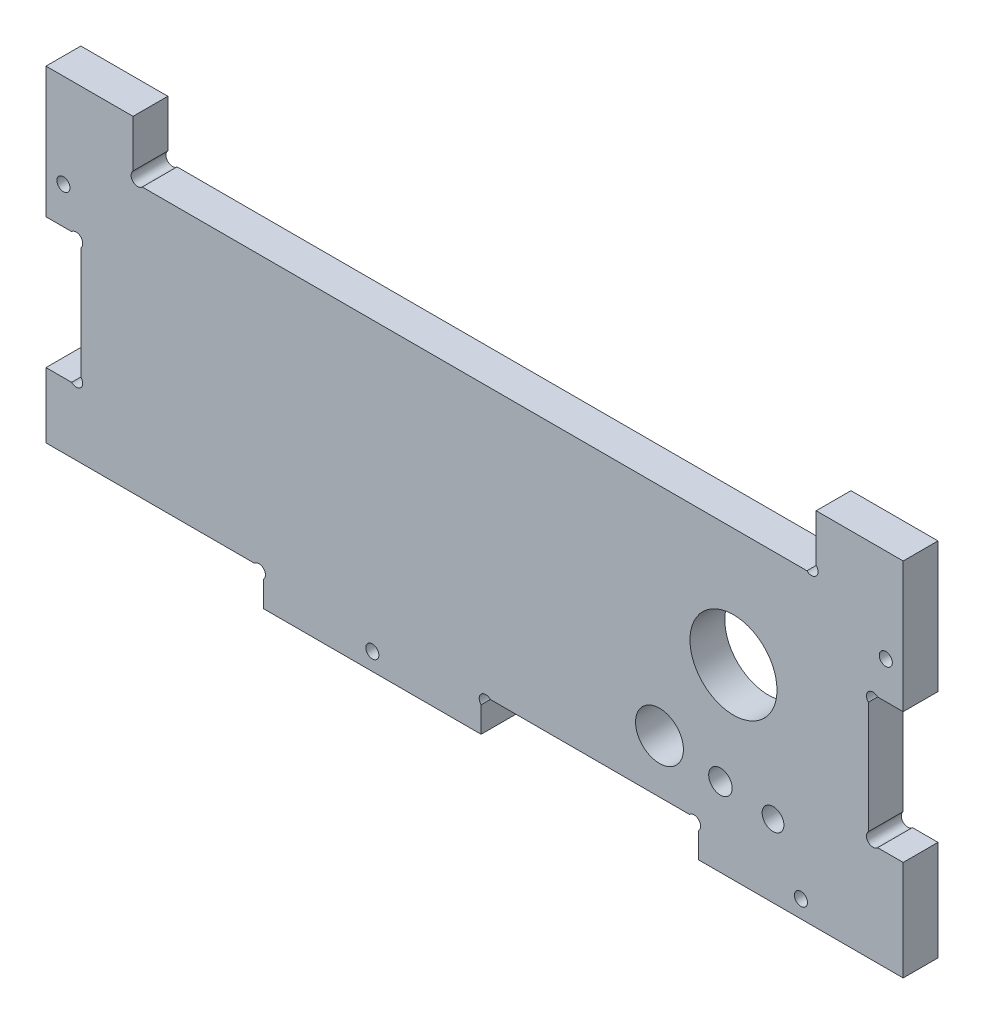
ISO-10303-21;
HEADER;
FILE_DESCRIPTION(('STEP AP214'),'2;1');
FILE_NAME('part.step','',(''),(''),'','','');
FILE_SCHEMA(('AUTOMOTIVE_DESIGN { 1 0 10303 214 1 1 1 1 }'));
ENDSEC;
DATA;
#1=APPLICATION_CONTEXT('core data for automotive mechanical design processes');
#2=APPLICATION_PROTOCOL_DEFINITION('international standard','automotive_design',2000,#1);
#3=PRODUCT_CONTEXT('',#1,'mechanical');
#4=PRODUCT('Part','Part','',(#3));
#5=PRODUCT_RELATED_PRODUCT_CATEGORY('part','',(#4));
#6=PRODUCT_DEFINITION_FORMATION('','',#4);
#7=PRODUCT_DEFINITION_CONTEXT('part definition',#1,'design');
#8=PRODUCT_DEFINITION('design','',#6,#7);
#9=PRODUCT_DEFINITION_SHAPE('','',#8);
#10=(LENGTH_UNIT() NAMED_UNIT(*) SI_UNIT(.MILLI.,.METRE.));
#11=(NAMED_UNIT(*) PLANE_ANGLE_UNIT() SI_UNIT($,.RADIAN.));
#12=(NAMED_UNIT(*) SI_UNIT($,.STERADIAN.) SOLID_ANGLE_UNIT());
#13=UNCERTAINTY_MEASURE_WITH_UNIT(LENGTH_MEASURE(1.E-05),#10,'distance_accuracy_value','');
#14=(GEOMETRIC_REPRESENTATION_CONTEXT(3) GLOBAL_UNCERTAINTY_ASSIGNED_CONTEXT((#13)) GLOBAL_UNIT_ASSIGNED_CONTEXT((#10,
#11,#12)) REPRESENTATION_CONTEXT('',''));
#15=CARTESIAN_POINT('',(0.,0.,0.));
#16=DIRECTION('',(0.,0.,1.));
#17=DIRECTION('',(1.,0.,0.));
#18=AXIS2_PLACEMENT_3D('',#15,#16,#17);
#19=CARTESIAN_POINT('',(-169.876335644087,-0.556228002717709,8.));
#20=DIRECTION('',(0.,0.,1.));
#21=DIRECTION('',(1.,0.,0.));
#22=AXIS2_PLACEMENT_3D('',#19,#20,#21);
#23=PLANE('',#22);
#24=CARTESIAN_POINT('',(16.1843245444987,36.8831118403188,8.));
#25=DIRECTION('',(0.,0.,1.));
#26=DIRECTION('',(1.,0.,0.));
#27=AXIS2_PLACEMENT_3D('',#24,#25,#26);
#28=CIRCLE('',#27,1.5);
#29=CARTESIAN_POINT('',(17.6843245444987,36.8831118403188,8.));
#30=VERTEX_POINT('',#29);
#31=EDGE_CURVE('E559',#30,#30,#28,.T.);
#32=ORIENTED_EDGE('',*,*,#31,.F.);
#33=EDGE_LOOP('',(#32));
#34=FACE_BOUND('',#33,.T.);
#35=CARTESIAN_POINT('',(-101.815675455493,-20.616888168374,8.));
#36=DIRECTION('',(0.,0.,1.));
#37=DIRECTION('',(1.,0.,0.));
#38=AXIS2_PLACEMENT_3D('',#35,#36,#37);
#39=CIRCLE('',#38,1.50000000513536);
#40=CARTESIAN_POINT('',(-100.315675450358,-20.616888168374,8.));
#41=VERTEX_POINT('',#40);
#42=EDGE_CURVE('E571',#41,#41,#39,.T.);
#43=ORIENTED_EDGE('',*,*,#42,.F.);
#44=EDGE_LOOP('',(#43));
#45=FACE_BOUND('',#44,.T.);
#46=CARTESIAN_POINT('',(-9.72907392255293,-7.92550919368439,8.));
#47=DIRECTION('',(0.,0.,1.));
#48=DIRECTION('',(1.,0.,0.));
#49=AXIS2_PLACEMENT_3D('',#46,#47,#48);
#50=CIRCLE('',#49,2.5);
#51=CARTESIAN_POINT('',(-7.22907392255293,-7.92550919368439,8.));
#52=VERTEX_POINT('',#51);
#53=EDGE_CURVE('E583',#52,#52,#50,.T.);
#54=ORIENTED_EDGE('',*,*,#53,.F.);
#55=EDGE_LOOP('',(#54));
#56=FACE_BOUND('',#55,.T.);
#57=CARTESIAN_POINT('',(-35.8243193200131,-4.41697217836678,8.));
#58=DIRECTION('',(0.,0.,1.));
#59=DIRECTION('',(1.,0.,0.));
#60=AXIS2_PLACEMENT_3D('',#57,#58,#59);
#61=CIRCLE('',#60,5.50000000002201);
#62=CARTESIAN_POINT('',(-30.3243193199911,-4.41697217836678,8.));
#63=VERTEX_POINT('',#62);
#64=EDGE_CURVE('E272',#63,#63,#61,.T.);
#65=ORIENTED_EDGE('',*,*,#64,.F.);
#66=EDGE_LOOP('',(#65));
#67=FACE_BOUND('',#66,.T.);
#68=DIRECTION('',(1.,0.,0.));
#69=VECTOR('',#68,1.);
#70=CARTESIAN_POINT('',(-128.936995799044,-16.6168881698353,8.));
#71=LINE('',#70,#69);
#72=CARTESIAN_POINT('',(-176.815675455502,-16.6168881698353,8.));
#73=VERTEX_POINT('',#72);
#74=CARTESIAN_POINT('',(-128.936995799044,-16.6168881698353,8.));
#75=VERTEX_POINT('',#74);
#76=EDGE_CURVE('E333',#73,#75,#71,.T.);
#77=ORIENTED_EDGE('',*,*,#76,.T.);
#78=CARTESIAN_POINT('',(-127.876335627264,-17.6775483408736,8.));
#79=DIRECTION('',(0.,0.,-1.));
#80=DIRECTION('',(1.,0.,0.));
#81=AXIS2_PLACEMENT_3D('',#78,#79,#80);
#82=CIRCLE('',#81,1.49999999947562);
#83=CARTESIAN_POINT('',(-126.815675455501,-18.7382085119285,8.));
#84=VERTEX_POINT('',#83);
#85=EDGE_CURVE('E162',#75,#84,#82,.T.);
#86=ORIENTED_EDGE('',*,*,#85,.T.);
#87=DIRECTION('',(0.,-1.,0.));
#88=VECTOR('',#87,1.);
#89=CARTESIAN_POINT('',(-126.815675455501,-24.616888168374,8.));
#90=LINE('',#89,#88);
#91=CARTESIAN_POINT('',(-126.815675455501,-24.616888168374,8.));
#92=VERTEX_POINT('',#91);
#93=EDGE_CURVE('E417',#84,#92,#90,.T.);
#94=ORIENTED_EDGE('',*,*,#93,.T.);
#95=DIRECTION('',(1.,0.,0.));
#96=VECTOR('',#95,1.);
#97=CARTESIAN_POINT('',(-76.8156754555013,-24.6168881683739,8.));
#98=LINE('',#97,#96);
#99=CARTESIAN_POINT('',(-76.8156754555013,-24.6168881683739,8.));
#100=VERTEX_POINT('',#99);
#101=EDGE_CURVE('E436',#92,#100,#98,.T.);
#102=ORIENTED_EDGE('',*,*,#101,.T.);
#103=DIRECTION('',(0.,1.,0.));
#104=VECTOR('',#103,1.);
#105=CARTESIAN_POINT('',(-76.8156754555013,-18.7382085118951,8.));
#106=LINE('',#105,#104);
#107=CARTESIAN_POINT('',(-76.8156754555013,-18.7382085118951,8.));
#108=VERTEX_POINT('',#107);
#109=EDGE_CURVE('E433',#100,#108,#106,.T.);
#110=ORIENTED_EDGE('',*,*,#109,.T.);
#111=CARTESIAN_POINT('',(-75.7550152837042,-17.6775483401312,8.));
#112=DIRECTION('',(0.,0.,-1.));
#113=DIRECTION('',(1.,0.,0.));
#114=AXIS2_PLACEMENT_3D('',#111,#112,#113);
#115=CIRCLE('',#114,1.50000000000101);
#116=CARTESIAN_POINT('',(-74.6943551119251,-16.6168881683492,8.));
#117=VERTEX_POINT('',#116);
#118=EDGE_CURVE('E435',#108,#117,#115,.T.);
#119=ORIENTED_EDGE('',*,*,#118,.T.);
#120=DIRECTION('',(1.,0.,0.));
#121=VECTOR('',#120,1.);
#122=CARTESIAN_POINT('',(-74.6943551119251,-16.6168881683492,8.));
#123=LINE('',#122,#121);
#124=CARTESIAN_POINT('',(-28.9369957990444,-16.6168881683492,8.));
#125=VERTEX_POINT('',#124);
#126=EDGE_CURVE('E438',#117,#125,#123,.T.);
#127=ORIENTED_EDGE('',*,*,#126,.T.);
#128=CARTESIAN_POINT('',(-27.8763356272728,-17.6775483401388,8.));
#129=DIRECTION('',(0.,0.,-1.));
#130=DIRECTION('',(1.,0.,0.));
#131=AXIS2_PLACEMENT_3D('',#128,#129,#130);
#132=CIRCLE('',#131,1.50000000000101);
#133=CARTESIAN_POINT('',(-26.8156754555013,-18.7382085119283,8.));
#134=VERTEX_POINT('',#133);
#135=EDGE_CURVE('E444',#125,#134,#132,.T.);
#136=ORIENTED_EDGE('',*,*,#135,.T.);
#137=DIRECTION('',(0.,-1.,0.));
#138=VECTOR('',#137,1.);
#139=CARTESIAN_POINT('',(-26.8156754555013,-24.6168881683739,8.));
#140=LINE('',#139,#138);
#141=CARTESIAN_POINT('',(-26.8156754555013,-24.6168881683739,8.));
#142=VERTEX_POINT('',#141);
#143=EDGE_CURVE('E446',#134,#142,#140,.T.);
#144=ORIENTED_EDGE('',*,*,#143,.T.);
#145=DIRECTION('',(1.,0.,0.));
#146=VECTOR('',#145,1.);
#147=CARTESIAN_POINT('',(20.1843245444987,-24.6168881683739,8.));
#148=LINE('',#147,#146);
#149=CARTESIAN_POINT('',(20.1843245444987,-24.6168881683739,8.));
#150=VERTEX_POINT('',#149);
#151=EDGE_CURVE('E448',#142,#150,#148,.T.);
#152=ORIENTED_EDGE('',*,*,#151,.T.);
#153=DIRECTION('',(0.,1.,0.));
#154=VECTOR('',#153,1.);
#155=CARTESIAN_POINT('',(20.1843245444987,-16.6168881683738,8.));
#156=LINE('',#155,#154);
#157=CARTESIAN_POINT('',(20.1843245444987,-1.61688817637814,8.));
#158=VERTEX_POINT('',#157);
#159=EDGE_CURVE('E450',#150,#158,#156,.T.);
#160=ORIENTED_EDGE('',*,*,#159,.T.);
#161=DIRECTION('',(-1.,0.,0.));
#162=VECTOR('',#161,1.);
#163=CARTESIAN_POINT('',(20.1843245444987,-1.61688817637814,8.));
#164=LINE('',#163,#162);
#165=CARTESIAN_POINT('',(14.305644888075,-1.61688817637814,8.));
#166=VERTEX_POINT('',#165);
#167=EDGE_CURVE('E452',#158,#166,#164,.T.);
#168=ORIENTED_EDGE('',*,*,#167,.T.);
#169=CARTESIAN_POINT('',(13.2449847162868,-0.556228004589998,8.));
#170=DIRECTION('',(0.,0.,-1.));
#171=DIRECTION('',(1.,0.,0.));
#172=AXIS2_PLACEMENT_3D('',#169,#170,#171);
#173=CIRCLE('',#172,1.50000000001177);
#174=CARTESIAN_POINT('',(12.1843245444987,0.504432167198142,8.));
#175=VERTEX_POINT('',#174);
#176=EDGE_CURVE('E454',#166,#175,#173,.T.);
#177=ORIENTED_EDGE('',*,*,#176,.T.);
#178=DIRECTION('',(0.,1.,0.));
#179=VECTOR('',#178,1.);
#180=CARTESIAN_POINT('',(12.1843245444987,0.504432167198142,8.));
#181=LINE('',#180,#179);
#182=CARTESIAN_POINT('',(12.1843245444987,26.2617914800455,8.));
#183=VERTEX_POINT('',#182);
#184=EDGE_CURVE('E456',#175,#183,#181,.T.);
#185=ORIENTED_EDGE('',*,*,#184,.T.);
#186=CARTESIAN_POINT('',(13.2449847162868,27.3224516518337,8.));
#187=DIRECTION('',(0.,0.,-1.));
#188=DIRECTION('',(1.,0.,0.));
#189=AXIS2_PLACEMENT_3D('',#186,#187,#188);
#190=CIRCLE('',#189,1.50000000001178);
#191=CARTESIAN_POINT('',(14.305644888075,28.3831118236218,8.));
#192=VERTEX_POINT('',#191);
#193=EDGE_CURVE('E458',#183,#192,#190,.T.);
#194=ORIENTED_EDGE('',*,*,#193,.T.);
#195=DIRECTION('',(1.,0.,0.));
#196=VECTOR('',#195,1.);
#197=CARTESIAN_POINT('',(14.305644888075,28.3831118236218,8.));
#198=LINE('',#197,#196);
#199=CARTESIAN_POINT('',(20.1843245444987,28.3831118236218,8.));
#200=VERTEX_POINT('',#199);
#201=EDGE_CURVE('E460',#192,#200,#198,.T.);
#202=ORIENTED_EDGE('',*,*,#201,.T.);
#203=DIRECTION('',(0.,1.,0.));
#204=VECTOR('',#203,1.);
#205=CARTESIAN_POINT('',(20.1843245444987,45.3831118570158,8.));
#206=LINE('',#205,#204);
#207=CARTESIAN_POINT('',(20.1843245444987,58.3831118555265,8.));
#208=VERTEX_POINT('',#207);
#209=EDGE_CURVE('E462',#200,#208,#206,.T.);
#210=ORIENTED_EDGE('',*,*,#209,.T.);
#211=DIRECTION('',(-1.,0.,0.));
#212=VECTOR('',#211,1.);
#213=CARTESIAN_POINT('',(20.1843245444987,58.3831118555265,8.));
#214=LINE('',#213,#212);
#215=CARTESIAN_POINT('',(0.184324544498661,58.3831118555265,8.));
#216=VERTEX_POINT('',#215);
#217=EDGE_CURVE('E464',#208,#216,#214,.T.);
#218=ORIENTED_EDGE('',*,*,#217,.T.);
#219=DIRECTION('',(0.,-1.,0.));
#220=VECTOR('',#219,1.);
#221=CARTESIAN_POINT('',(0.184324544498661,58.3831118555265,8.));
#222=LINE('',#221,#220);
#223=CARTESIAN_POINT('',(0.184324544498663,47.5044322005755,8.));
#224=VERTEX_POINT('',#223);
#225=EDGE_CURVE('E466',#216,#224,#222,.T.);
#226=ORIENTED_EDGE('',*,*,#225,.T.);
#227=CARTESIAN_POINT('',(-0.876335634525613,46.4437720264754,8.));
#228=DIRECTION('',(0.,0.,-1.));
#229=DIRECTION('',(1.,0.,0.));
#230=AXIS2_PLACEMENT_3D('',#227,#228,#229);
#231=CIRCLE('',#230,1.50000000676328);
#232=CARTESIAN_POINT('',(-1.93699581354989,45.3831118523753,8.));
#233=VERTEX_POINT('',#232);
#234=EDGE_CURVE('E468',#224,#233,#231,.T.);
#235=ORIENTED_EDGE('',*,*,#234,.T.);
#236=DIRECTION('',(-1.,0.,0.));
#237=VECTOR('',#236,1.);
#238=CARTESIAN_POINT('',(-118.936995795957,45.3831118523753,8.));
#239=LINE('',#238,#237);
#240=CARTESIAN_POINT('',(-154.694355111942,45.3831118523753,8.));
#241=VERTEX_POINT('',#240);
#242=EDGE_CURVE('E470',#233,#241,#239,.T.);
#243=ORIENTED_EDGE('',*,*,#242,.T.);
#244=CARTESIAN_POINT('',(-155.755015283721,46.4437720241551,8.));
#245=DIRECTION('',(0.,0.,-1.));
#246=DIRECTION('',(1.,0.,0.));
#247=AXIS2_PLACEMENT_3D('',#244,#245,#246);
#248=CIRCLE('',#247,1.49999999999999);
#249=CARTESIAN_POINT('',(-156.815675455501,47.5044321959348,8.));
#250=VERTEX_POINT('',#249);
#251=EDGE_CURVE('E472',#241,#250,#248,.T.);
#252=ORIENTED_EDGE('',*,*,#251,.T.);
#253=DIRECTION('',(0.,1.,0.));
#254=VECTOR('',#253,1.);
#255=CARTESIAN_POINT('',(-156.815675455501,58.383111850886,8.));
#256=LINE('',#255,#254);
#257=CARTESIAN_POINT('',(-156.815675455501,58.383111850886,8.));
#258=VERTEX_POINT('',#257);
#259=EDGE_CURVE('E474',#250,#258,#256,.T.);
#260=ORIENTED_EDGE('',*,*,#259,.T.);
#261=DIRECTION('',(-1.,0.,0.));
#262=VECTOR('',#261,1.);
#263=CARTESIAN_POINT('',(-176.815675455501,58.383111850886,8.));
#264=LINE('',#263,#262);
#265=CARTESIAN_POINT('',(-176.815675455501,58.383111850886,8.));
#266=VERTEX_POINT('',#265);
#267=EDGE_CURVE('E476',#258,#266,#264,.T.);
#268=ORIENTED_EDGE('',*,*,#267,.T.);
#269=DIRECTION('',(0.,-1.,0.));
#270=VECTOR('',#269,1.);
#271=CARTESIAN_POINT('',(-176.815675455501,45.3831118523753,8.));
#272=LINE('',#271,#270);
#273=CARTESIAN_POINT('',(-176.815675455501,28.3831118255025,8.));
#274=VERTEX_POINT('',#273);
#275=EDGE_CURVE('E478',#266,#274,#272,.T.);
#276=ORIENTED_EDGE('',*,*,#275,.T.);
#277=DIRECTION('',(1.,0.,0.));
#278=VECTOR('',#277,1.);
#279=CARTESIAN_POINT('',(-170.936995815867,28.3831118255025,8.));
#280=LINE('',#279,#278);
#281=CARTESIAN_POINT('',(-170.936995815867,28.3831118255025,8.));
#282=VERTEX_POINT('',#281);
#283=EDGE_CURVE('E480',#274,#282,#280,.T.);
#284=ORIENTED_EDGE('',*,*,#283,.T.);
#285=CARTESIAN_POINT('',(-169.876335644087,27.3224516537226,8.));
#286=DIRECTION('',(0.,0.,-1.));
#287=DIRECTION('',(1.,0.,0.));
#288=AXIS2_PLACEMENT_3D('',#285,#286,#287);
#289=CIRCLE('',#288,1.49999999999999);
#290=CARTESIAN_POINT('',(-168.815675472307,26.2617914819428,8.));
#291=VERTEX_POINT('',#290);
#292=EDGE_CURVE('E482',#282,#291,#289,.T.);
#293=ORIENTED_EDGE('',*,*,#292,.T.);
#294=DIRECTION('',(0.,-1.,0.));
#295=VECTOR('',#294,1.);
#296=CARTESIAN_POINT('',(-168.815675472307,0.504432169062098,8.));
#297=LINE('',#296,#295);
#298=CARTESIAN_POINT('',(-168.815675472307,0.504432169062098,8.));
#299=VERTEX_POINT('',#298);
#300=EDGE_CURVE('E250',#291,#299,#297,.T.);
#301=ORIENTED_EDGE('',*,*,#300,.T.);
#302=CARTESIAN_POINT('',(-169.876335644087,-0.556228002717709,8.));
#303=DIRECTION('',(0.,0.,-1.));
#304=DIRECTION('',(1.,0.,0.));
#305=AXIS2_PLACEMENT_3D('',#302,#303,#304);
#306=CIRCLE('',#305,1.5);
#307=CARTESIAN_POINT('',(-170.936995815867,-1.61688817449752,8.));
#308=VERTEX_POINT('',#307);
#309=EDGE_CURVE('E244',#299,#308,#306,.T.);
#310=ORIENTED_EDGE('',*,*,#309,.T.);
#311=DIRECTION('',(-1.,0.,0.));
#312=VECTOR('',#311,1.);
#313=CARTESIAN_POINT('',(-176.815675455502,-1.61688817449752,8.));
#314=LINE('',#313,#312);
#315=CARTESIAN_POINT('',(-176.815675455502,-1.61688817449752,8.));
#316=VERTEX_POINT('',#315);
#317=EDGE_CURVE('E248',#308,#316,#314,.T.);
#318=ORIENTED_EDGE('',*,*,#317,.T.);
#319=DIRECTION('',(0.,-1.,0.));
#320=VECTOR('',#319,1.);
#321=CARTESIAN_POINT('',(-176.815675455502,-16.6168881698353,8.));
#322=LINE('',#321,#320);
#323=EDGE_CURVE('E50',#316,#73,#322,.T.);
#324=ORIENTED_EDGE('',*,*,#323,.T.);
#325=EDGE_LOOP('',(#77,#86,#94,#102,#110,#119,#127,#136,#144,#152,#160,#168,#177,#185,#194,#202,
#210,#218,#226,#235,#243,#252,#260,#268,#276,#284,#293,#301,#310,#318,#324));
#326=FACE_BOUND('',#325,.T.);
#327=CARTESIAN_POINT('',(-21.8179754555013,-6.51688817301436,8.));
#328=DIRECTION('',(0.,0.,1.));
#329=DIRECTION('',(1.,0.,0.));
#330=AXIS2_PLACEMENT_3D('',#327,#328,#329);
#331=CIRCLE('',#330,2.7);
#332=CARTESIAN_POINT('',(-19.1179754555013,-6.51688817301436,8.));
#333=VERTEX_POINT('',#332);
#334=EDGE_CURVE('E589',#333,#333,#331,.T.);
#335=ORIENTED_EDGE('',*,*,#334,.F.);
#336=EDGE_LOOP('',(#335));
#337=FACE_BOUND('',#336,.T.);
#338=CARTESIAN_POINT('',(-18.8179755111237,18.1956580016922,8.));
#339=DIRECTION('',(0.,0.,1.));
#340=DIRECTION('',(1.,0.,0.));
#341=AXIS2_PLACEMENT_3D('',#338,#339,#340);
#342=CIRCLE('',#341,10.);
#343=CARTESIAN_POINT('',(-8.81797551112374,18.1956580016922,8.));
#344=VERTEX_POINT('',#343);
#345=EDGE_CURVE('E577',#344,#344,#342,.T.);
#346=ORIENTED_EDGE('',*,*,#345,.F.);
#347=EDGE_LOOP('',(#346));
#348=FACE_BOUND('',#347,.T.);
#349=CARTESIAN_POINT('',(-3.31567545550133,-20.6168881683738,8.));
#350=DIRECTION('',(0.,0.,1.));
#351=DIRECTION('',(1.,0.,0.));
#352=AXIS2_PLACEMENT_3D('',#349,#350,#351);
#353=CIRCLE('',#352,1.49999999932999);
#354=CARTESIAN_POINT('',(-1.81567545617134,-20.6168881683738,8.));
#355=VERTEX_POINT('',#354);
#356=EDGE_CURVE('E565',#355,#355,#353,.T.);
#357=ORIENTED_EDGE('',*,*,#356,.F.);
#358=EDGE_LOOP('',(#357));
#359=FACE_BOUND('',#358,.T.);
#360=CARTESIAN_POINT('',(-172.815675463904,36.8831118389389,8.));
#361=DIRECTION('',(0.,0.,1.));
#362=DIRECTION('',(1.,0.,0.));
#363=AXIS2_PLACEMENT_3D('',#360,#361,#362);
#364=CIRCLE('',#363,1.5);
#365=CARTESIAN_POINT('',(-171.315675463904,36.8831118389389,8.));
#366=VERTEX_POINT('',#365);
#367=EDGE_CURVE('E550',#366,#366,#364,.T.);
#368=ORIENTED_EDGE('',*,*,#367,.F.);
#369=EDGE_LOOP('',(#368));
#370=FACE_BOUND('',#369,.T.);
#371=ADVANCED_FACE('F33',(#34,#45,#56,#67,#326,#337,#348,#359,#370),#23,.T.);
#372=CARTESIAN_POINT('',(-169.876335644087,-0.556228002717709,0.));
#373=DIRECTION('',(0.,0.,1.));
#374=DIRECTION('',(1.,0.,0.));
#375=AXIS2_PLACEMENT_3D('',#372,#373,#374);
#376=PLANE('',#375);
#377=CARTESIAN_POINT('',(16.1843245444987,36.8831118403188,0.));
#378=DIRECTION('',(0.,0.,1.));
#379=DIRECTION('',(1.,0.,0.));
#380=AXIS2_PLACEMENT_3D('',#377,#378,#379);
#381=CIRCLE('',#380,1.5);
#382=CARTESIAN_POINT('',(17.6843245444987,36.8831118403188,0.));
#383=VERTEX_POINT('',#382);
#384=EDGE_CURVE('E556',#383,#383,#381,.T.);
#385=ORIENTED_EDGE('',*,*,#384,.T.);
#386=EDGE_LOOP('',(#385));
#387=FACE_BOUND('',#386,.T.);
#388=CARTESIAN_POINT('',(-101.815675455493,-20.616888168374,0.));
#389=DIRECTION('',(0.,0.,1.));
#390=DIRECTION('',(1.,0.,0.));
#391=AXIS2_PLACEMENT_3D('',#388,#389,#390);
#392=CIRCLE('',#391,1.50000000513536);
#393=CARTESIAN_POINT('',(-100.315675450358,-20.616888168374,0.));
#394=VERTEX_POINT('',#393);
#395=EDGE_CURVE('E568',#394,#394,#392,.T.);
#396=ORIENTED_EDGE('',*,*,#395,.T.);
#397=EDGE_LOOP('',(#396));
#398=FACE_BOUND('',#397,.T.);
#399=CARTESIAN_POINT('',(-9.72907392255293,-7.92550919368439,0.));
#400=DIRECTION('',(0.,0.,1.));
#401=DIRECTION('',(1.,0.,0.));
#402=AXIS2_PLACEMENT_3D('',#399,#400,#401);
#403=CIRCLE('',#402,2.5);
#404=CARTESIAN_POINT('',(-7.22907392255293,-7.92550919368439,0.));
#405=VERTEX_POINT('',#404);
#406=EDGE_CURVE('E580',#405,#405,#403,.T.);
#407=ORIENTED_EDGE('',*,*,#406,.T.);
#408=EDGE_LOOP('',(#407));
#409=FACE_BOUND('',#408,.T.);
#410=CARTESIAN_POINT('',(-35.8243193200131,-4.41697217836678,0.));
#411=DIRECTION('',(0.,0.,1.));
#412=DIRECTION('',(1.,0.,0.));
#413=AXIS2_PLACEMENT_3D('',#410,#411,#412);
#414=CIRCLE('',#413,5.50000000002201);
#415=CARTESIAN_POINT('',(-30.3243193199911,-4.41697217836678,0.));
#416=VERTEX_POINT('',#415);
#417=EDGE_CURVE('E592',#416,#416,#414,.T.);
#418=ORIENTED_EDGE('',*,*,#417,.T.);
#419=EDGE_LOOP('',(#418));
#420=FACE_BOUND('',#419,.T.);
#421=DIRECTION('',(1.,0.,0.));
#422=VECTOR('',#421,1.);
#423=CARTESIAN_POINT('',(-128.936995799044,-16.6168881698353,0.));
#424=LINE('',#423,#422);
#425=CARTESIAN_POINT('',(-176.815675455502,-16.6168881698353,0.));
#426=VERTEX_POINT('',#425);
#427=CARTESIAN_POINT('',(-128.936995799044,-16.6168881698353,0.));
#428=VERTEX_POINT('',#427);
#429=EDGE_CURVE('E268',#426,#428,#424,.T.);
#430=ORIENTED_EDGE('',*,*,#429,.F.);
#431=DIRECTION('',(0.,-1.,0.));
#432=VECTOR('',#431,1.);
#433=CARTESIAN_POINT('',(-176.815675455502,-16.6168881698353,0.));
#434=LINE('',#433,#432);
#435=CARTESIAN_POINT('',(-176.815675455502,-1.61688817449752,0.));
#436=VERTEX_POINT('',#435);
#437=EDGE_CURVE('E154',#436,#426,#434,.T.);
#438=ORIENTED_EDGE('',*,*,#437,.F.);
#439=DIRECTION('',(-1.,0.,0.));
#440=VECTOR('',#439,1.);
#441=CARTESIAN_POINT('',(-176.815675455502,-1.61688817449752,0.));
#442=LINE('',#441,#440);
#443=CARTESIAN_POINT('',(-170.936995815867,-1.61688817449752,0.));
#444=VERTEX_POINT('',#443);
#445=EDGE_CURVE('E148',#444,#436,#442,.T.);
#446=ORIENTED_EDGE('',*,*,#445,.F.);
#447=CARTESIAN_POINT('',(-169.876335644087,-0.556228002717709,0.));
#448=DIRECTION('',(0.,0.,-1.));
#449=DIRECTION('',(1.,0.,0.));
#450=AXIS2_PLACEMENT_3D('',#447,#448,#449);
#451=CIRCLE('',#450,1.5);
#452=CARTESIAN_POINT('',(-168.815675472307,0.504432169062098,0.));
#453=VERTEX_POINT('',#452);
#454=EDGE_CURVE('E258',#453,#444,#451,.T.);
#455=ORIENTED_EDGE('',*,*,#454,.F.);
#456=DIRECTION('',(0.,-1.,0.));
#457=VECTOR('',#456,1.);
#458=CARTESIAN_POINT('',(-168.815675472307,0.504432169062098,0.));
#459=LINE('',#458,#457);
#460=CARTESIAN_POINT('',(-168.815675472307,26.2617914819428,0.));
#461=VERTEX_POINT('',#460);
#462=EDGE_CURVE('E328',#461,#453,#459,.T.);
#463=ORIENTED_EDGE('',*,*,#462,.F.);
#464=CARTESIAN_POINT('',(-169.876335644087,27.3224516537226,0.));
#465=DIRECTION('',(0.,0.,-1.));
#466=DIRECTION('',(1.,0.,0.));
#467=AXIS2_PLACEMENT_3D('',#464,#465,#466);
#468=CIRCLE('',#467,1.49999999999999);
#469=CARTESIAN_POINT('',(-170.936995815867,28.3831118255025,0.));
#470=VERTEX_POINT('',#469);
#471=EDGE_CURVE('E326',#470,#461,#468,.T.);
#472=ORIENTED_EDGE('',*,*,#471,.F.);
#473=DIRECTION('',(1.,0.,0.));
#474=VECTOR('',#473,1.);
#475=CARTESIAN_POINT('',(-170.936995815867,28.3831118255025,0.));
#476=LINE('',#475,#474);
#477=CARTESIAN_POINT('',(-176.815675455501,28.3831118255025,0.));
#478=VERTEX_POINT('',#477);
#479=EDGE_CURVE('E324',#478,#470,#476,.T.);
#480=ORIENTED_EDGE('',*,*,#479,.F.);
#481=DIRECTION('',(0.,-1.,0.));
#482=VECTOR('',#481,1.);
#483=CARTESIAN_POINT('',(-176.815675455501,28.3831118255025,0.));
#484=LINE('',#483,#482);
#485=CARTESIAN_POINT('',(-176.815675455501,58.383111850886,0.));
#486=VERTEX_POINT('',#485);
#487=EDGE_CURVE('E322',#486,#478,#484,.T.);
#488=ORIENTED_EDGE('',*,*,#487,.F.);
#489=DIRECTION('',(-1.,0.,0.));
#490=VECTOR('',#489,1.);
#491=CARTESIAN_POINT('',(-176.815675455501,58.383111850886,0.));
#492=LINE('',#491,#490);
#493=CARTESIAN_POINT('',(-156.815675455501,58.383111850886,0.));
#494=VERTEX_POINT('',#493);
#495=EDGE_CURVE('E319',#494,#486,#492,.T.);
#496=ORIENTED_EDGE('',*,*,#495,.F.);
#497=DIRECTION('',(0.,1.,0.));
#498=VECTOR('',#497,1.);
#499=CARTESIAN_POINT('',(-156.815675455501,58.383111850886,0.));
#500=LINE('',#499,#498);
#501=CARTESIAN_POINT('',(-156.815675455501,47.5044321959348,0.));
#502=VERTEX_POINT('',#501);
#503=EDGE_CURVE('E317',#502,#494,#500,.T.);
#504=ORIENTED_EDGE('',*,*,#503,.F.);
#505=CARTESIAN_POINT('',(-155.755015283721,46.4437720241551,0.));
#506=DIRECTION('',(0.,0.,-1.));
#507=DIRECTION('',(1.,0.,0.));
#508=AXIS2_PLACEMENT_3D('',#505,#506,#507);
#509=CIRCLE('',#508,1.49999999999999);
#510=CARTESIAN_POINT('',(-154.694355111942,45.3831118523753,0.));
#511=VERTEX_POINT('',#510);
#512=EDGE_CURVE('E315',#511,#502,#509,.T.);
#513=ORIENTED_EDGE('',*,*,#512,.F.);
#514=DIRECTION('',(-1.,0.,0.));
#515=VECTOR('',#514,1.);
#516=CARTESIAN_POINT('',(-154.694355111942,45.3831118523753,0.));
#517=LINE('',#516,#515);
#518=CARTESIAN_POINT('',(-1.93699581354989,45.3831118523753,0.));
#519=VERTEX_POINT('',#518);
#520=EDGE_CURVE('E313',#519,#511,#517,.T.);
#521=ORIENTED_EDGE('',*,*,#520,.F.);
#522=CARTESIAN_POINT('',(-0.876335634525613,46.4437720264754,0.));
#523=DIRECTION('',(0.,0.,-1.));
#524=DIRECTION('',(1.,0.,0.));
#525=AXIS2_PLACEMENT_3D('',#522,#523,#524);
#526=CIRCLE('',#525,1.50000000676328);
#527=CARTESIAN_POINT('',(0.184324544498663,47.5044322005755,0.));
#528=VERTEX_POINT('',#527);
#529=EDGE_CURVE('E310',#528,#519,#526,.T.);
#530=ORIENTED_EDGE('',*,*,#529,.F.);
#531=DIRECTION('',(0.,-1.,0.));
#532=VECTOR('',#531,1.);
#533=CARTESIAN_POINT('',(0.184324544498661,58.3831118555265,0.));
#534=LINE('',#533,#532);
#535=CARTESIAN_POINT('',(0.184324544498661,58.3831118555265,0.));
#536=VERTEX_POINT('',#535);
#537=EDGE_CURVE('E308',#536,#528,#534,.T.);
#538=ORIENTED_EDGE('',*,*,#537,.F.);
#539=DIRECTION('',(-1.,0.,0.));
#540=VECTOR('',#539,1.);
#541=CARTESIAN_POINT('',(20.1843245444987,58.3831118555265,0.));
#542=LINE('',#541,#540);
#543=CARTESIAN_POINT('',(20.1843245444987,58.3831118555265,0.));
#544=VERTEX_POINT('',#543);
#545=EDGE_CURVE('E306',#544,#536,#542,.T.);
#546=ORIENTED_EDGE('',*,*,#545,.F.);
#547=DIRECTION('',(0.,1.,0.));
#548=VECTOR('',#547,1.);
#549=CARTESIAN_POINT('',(20.1843245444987,45.3831118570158,0.));
#550=LINE('',#549,#548);
#551=CARTESIAN_POINT('',(20.1843245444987,28.3831118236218,0.));
#552=VERTEX_POINT('',#551);
#553=EDGE_CURVE('E304',#552,#544,#550,.T.);
#554=ORIENTED_EDGE('',*,*,#553,.F.);
#555=DIRECTION('',(1.,0.,0.));
#556=VECTOR('',#555,1.);
#557=CARTESIAN_POINT('',(14.305644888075,28.3831118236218,0.));
#558=LINE('',#557,#556);
#559=CARTESIAN_POINT('',(14.305644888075,28.3831118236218,0.));
#560=VERTEX_POINT('',#559);
#561=EDGE_CURVE('E301',#560,#552,#558,.T.);
#562=ORIENTED_EDGE('',*,*,#561,.F.);
#563=CARTESIAN_POINT('',(13.2449847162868,27.3224516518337,0.));
#564=DIRECTION('',(0.,0.,-1.));
#565=DIRECTION('',(1.,0.,0.));
#566=AXIS2_PLACEMENT_3D('',#563,#564,#565);
#567=CIRCLE('',#566,1.50000000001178);
#568=CARTESIAN_POINT('',(12.1843245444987,26.2617914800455,0.));
#569=VERTEX_POINT('',#568);
#570=EDGE_CURVE('E299',#569,#560,#567,.T.);
#571=ORIENTED_EDGE('',*,*,#570,.F.);
#572=DIRECTION('',(0.,1.,0.));
#573=VECTOR('',#572,1.);
#574=CARTESIAN_POINT('',(12.1843245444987,0.504432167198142,0.));
#575=LINE('',#574,#573);
#576=CARTESIAN_POINT('',(12.1843245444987,0.504432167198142,0.));
#577=VERTEX_POINT('',#576);
#578=EDGE_CURVE('E297',#577,#569,#575,.T.);
#579=ORIENTED_EDGE('',*,*,#578,.F.);
#580=CARTESIAN_POINT('',(13.2449847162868,-0.556228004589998,0.));
#581=DIRECTION('',(0.,0.,-1.));
#582=DIRECTION('',(1.,0.,0.));
#583=AXIS2_PLACEMENT_3D('',#580,#581,#582);
#584=CIRCLE('',#583,1.50000000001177);
#585=CARTESIAN_POINT('',(14.305644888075,-1.61688817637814,0.));
#586=VERTEX_POINT('',#585);
#587=EDGE_CURVE('E295',#586,#577,#584,.T.);
#588=ORIENTED_EDGE('',*,*,#587,.F.);
#589=DIRECTION('',(-1.,0.,0.));
#590=VECTOR('',#589,1.);
#591=CARTESIAN_POINT('',(20.1843245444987,-1.61688817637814,0.));
#592=LINE('',#591,#590);
#593=CARTESIAN_POINT('',(20.1843245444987,-1.61688817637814,0.));
#594=VERTEX_POINT('',#593);
#595=EDGE_CURVE('E293',#594,#586,#592,.T.);
#596=ORIENTED_EDGE('',*,*,#595,.F.);
#597=DIRECTION('',(0.,1.,0.));
#598=VECTOR('',#597,1.);
#599=CARTESIAN_POINT('',(20.1843245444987,-1.61688817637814,0.));
#600=LINE('',#599,#598);
#601=CARTESIAN_POINT('',(20.1843245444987,-24.6168881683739,0.));
#602=VERTEX_POINT('',#601);
#603=EDGE_CURVE('E291',#602,#594,#600,.T.);
#604=ORIENTED_EDGE('',*,*,#603,.F.);
#605=DIRECTION('',(1.,0.,0.));
#606=VECTOR('',#605,1.);
#607=CARTESIAN_POINT('',(20.1843245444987,-24.6168881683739,0.));
#608=LINE('',#607,#606);
#609=CARTESIAN_POINT('',(-26.8156754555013,-24.6168881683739,0.));
#610=VERTEX_POINT('',#609);
#611=EDGE_CURVE('E288',#610,#602,#608,.T.);
#612=ORIENTED_EDGE('',*,*,#611,.F.);
#613=DIRECTION('',(0.,-1.,0.));
#614=VECTOR('',#613,1.);
#615=CARTESIAN_POINT('',(-26.8156754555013,-24.6168881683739,0.));
#616=LINE('',#615,#614);
#617=CARTESIAN_POINT('',(-26.8156754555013,-18.7382085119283,0.));
#618=VERTEX_POINT('',#617);
#619=EDGE_CURVE('E286',#618,#610,#616,.T.);
#620=ORIENTED_EDGE('',*,*,#619,.F.);
#621=CARTESIAN_POINT('',(-27.8763356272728,-17.6775483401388,0.));
#622=DIRECTION('',(0.,0.,-1.));
#623=DIRECTION('',(1.,0.,0.));
#624=AXIS2_PLACEMENT_3D('',#621,#622,#623);
#625=CIRCLE('',#624,1.50000000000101);
#626=CARTESIAN_POINT('',(-28.9369957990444,-16.6168881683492,0.));
#627=VERTEX_POINT('',#626);
#628=EDGE_CURVE('E284',#627,#618,#625,.T.);
#629=ORIENTED_EDGE('',*,*,#628,.F.);
#630=DIRECTION('',(1.,0.,0.));
#631=VECTOR('',#630,1.);
#632=CARTESIAN_POINT('',(-74.6943551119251,-16.6168881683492,0.));
#633=LINE('',#632,#631);
#634=CARTESIAN_POINT('',(-74.6943551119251,-16.6168881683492,0.));
#635=VERTEX_POINT('',#634);
#636=EDGE_CURVE('E282',#635,#627,#633,.T.);
#637=ORIENTED_EDGE('',*,*,#636,.F.);
#638=CARTESIAN_POINT('',(-75.7550152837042,-17.6775483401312,0.));
#639=DIRECTION('',(0.,0.,-1.));
#640=DIRECTION('',(1.,0.,0.));
#641=AXIS2_PLACEMENT_3D('',#638,#639,#640);
#642=CIRCLE('',#641,1.50000000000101);
#643=CARTESIAN_POINT('',(-76.8156754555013,-18.7382085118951,0.));
#644=VERTEX_POINT('',#643);
#645=EDGE_CURVE('E280',#644,#635,#642,.T.);
#646=ORIENTED_EDGE('',*,*,#645,.F.);
#647=DIRECTION('',(0.,1.,0.));
#648=VECTOR('',#647,1.);
#649=CARTESIAN_POINT('',(-76.8156754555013,-18.7382085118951,0.));
#650=LINE('',#649,#648);
#651=CARTESIAN_POINT('',(-76.8156754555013,-24.6168881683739,0.));
#652=VERTEX_POINT('',#651);
#653=EDGE_CURVE('E278',#652,#644,#650,.T.);
#654=ORIENTED_EDGE('',*,*,#653,.F.);
#655=DIRECTION('',(1.,0.,0.));
#656=VECTOR('',#655,1.);
#657=CARTESIAN_POINT('',(-76.8156754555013,-24.6168881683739,0.));
#658=LINE('',#657,#656);
#659=CARTESIAN_POINT('',(-126.815675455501,-24.616888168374,0.));
#660=VERTEX_POINT('',#659);
#661=EDGE_CURVE('E276',#660,#652,#658,.T.);
#662=ORIENTED_EDGE('',*,*,#661,.F.);
#663=DIRECTION('',(0.,-1.,0.));
#664=VECTOR('',#663,1.);
#665=CARTESIAN_POINT('',(-126.815675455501,-24.616888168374,0.));
#666=LINE('',#665,#664);
#667=CARTESIAN_POINT('',(-126.815675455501,-18.7382085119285,0.));
#668=VERTEX_POINT('',#667);
#669=EDGE_CURVE('E274',#668,#660,#666,.T.);
#670=ORIENTED_EDGE('',*,*,#669,.F.);
#671=CARTESIAN_POINT('',(-127.876335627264,-17.6775483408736,0.));
#672=DIRECTION('',(0.,0.,-1.));
#673=DIRECTION('',(1.,0.,0.));
#674=AXIS2_PLACEMENT_3D('',#671,#672,#673);
#675=CIRCLE('',#674,1.49999999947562);
#676=EDGE_CURVE('E271',#428,#668,#675,.T.);
#677=ORIENTED_EDGE('',*,*,#676,.F.);
#678=EDGE_LOOP('',(#430,#438,#446,#455,#463,#472,#480,#488,#496,#504,#513,#521,#530,#538,#546,
#554,#562,#571,#579,#588,#596,#604,#612,#620,#629,#637,#646,#654,#662,#670,#677));
#679=FACE_BOUND('',#678,.T.);
#680=CARTESIAN_POINT('',(-21.8179754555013,-6.51688817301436,0.));
#681=DIRECTION('',(0.,0.,1.));
#682=DIRECTION('',(1.,0.,0.));
#683=AXIS2_PLACEMENT_3D('',#680,#681,#682);
#684=CIRCLE('',#683,2.7);
#685=CARTESIAN_POINT('',(-19.1179754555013,-6.51688817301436,0.));
#686=VERTEX_POINT('',#685);
#687=EDGE_CURVE('E586',#686,#686,#684,.T.);
#688=ORIENTED_EDGE('',*,*,#687,.T.);
#689=EDGE_LOOP('',(#688));
#690=FACE_BOUND('',#689,.T.);
#691=CARTESIAN_POINT('',(-18.8179755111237,18.1956580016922,0.));
#692=DIRECTION('',(0.,0.,1.));
#693=DIRECTION('',(1.,0.,0.));
#694=AXIS2_PLACEMENT_3D('',#691,#692,#693);
#695=CIRCLE('',#694,10.);
#696=CARTESIAN_POINT('',(-8.81797551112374,18.1956580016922,0.));
#697=VERTEX_POINT('',#696);
#698=EDGE_CURVE('E574',#697,#697,#695,.T.);
#699=ORIENTED_EDGE('',*,*,#698,.T.);
#700=EDGE_LOOP('',(#699));
#701=FACE_BOUND('',#700,.T.);
#702=CARTESIAN_POINT('',(-3.31567545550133,-20.6168881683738,0.));
#703=DIRECTION('',(0.,0.,1.));
#704=DIRECTION('',(1.,0.,0.));
#705=AXIS2_PLACEMENT_3D('',#702,#703,#704);
#706=CIRCLE('',#705,1.49999999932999);
#707=CARTESIAN_POINT('',(-1.81567545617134,-20.6168881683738,0.));
#708=VERTEX_POINT('',#707);
#709=EDGE_CURVE('E562',#708,#708,#706,.T.);
#710=ORIENTED_EDGE('',*,*,#709,.T.);
#711=EDGE_LOOP('',(#710));
#712=FACE_BOUND('',#711,.T.);
#713=CARTESIAN_POINT('',(-172.815675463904,36.8831118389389,0.));
#714=DIRECTION('',(0.,0.,1.));
#715=DIRECTION('',(1.,0.,0.));
#716=AXIS2_PLACEMENT_3D('',#713,#714,#715);
#717=CIRCLE('',#716,1.5);
#718=CARTESIAN_POINT('',(-171.315675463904,36.8831118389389,0.));
#719=VERTEX_POINT('',#718);
#720=EDGE_CURVE('E553',#719,#719,#717,.T.);
#721=ORIENTED_EDGE('',*,*,#720,.T.);
#722=EDGE_LOOP('',(#721));
#723=FACE_BOUND('',#722,.T.);
#724=ADVANCED_FACE('F421',(#387,#398,#409,#420,#679,#690,#701,#712,#723),#376,.F.);
#725=CARTESIAN_POINT('',(-128.936995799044,-16.6168881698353,8.));
#726=DIRECTION('',(0.,1.,0.));
#727=DIRECTION('',(-1.,0.,0.));
#728=AXIS2_PLACEMENT_3D('',#725,#726,#727);
#729=PLANE('',#728);
#730=ORIENTED_EDGE('',*,*,#429,.T.);
#731=DIRECTION('',(0.,0.,-1.));
#732=VECTOR('',#731,1.);
#733=CARTESIAN_POINT('',(-128.936995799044,-16.6168881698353,8.));
#734=LINE('',#733,#732);
#735=EDGE_CURVE('E11',#75,#428,#734,.T.);
#736=ORIENTED_EDGE('',*,*,#735,.F.);
#737=ORIENTED_EDGE('',*,*,#76,.F.);
#738=DIRECTION('',(0.,0.,-1.));
#739=VECTOR('',#738,1.);
#740=CARTESIAN_POINT('',(-176.815675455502,-16.6168881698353,8.));
#741=LINE('',#740,#739);
#742=EDGE_CURVE('E264',#73,#426,#741,.T.);
#743=ORIENTED_EDGE('',*,*,#742,.T.);
#744=EDGE_LOOP('',(#730,#736,#737,#743));
#745=FACE_BOUND('',#744,.T.);
#746=ADVANCED_FACE('F35',(#745),#729,.F.);
#747=CARTESIAN_POINT('',(-127.876335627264,-17.6775483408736,8.));
#748=DIRECTION('',(0.,0.,-1.));
#749=DIRECTION('',(-1.,0.,0.));
#750=AXIS2_PLACEMENT_3D('',#747,#748,#749);
#751=CYLINDRICAL_SURFACE('',#750,1.49999999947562);
#752=ORIENTED_EDGE('',*,*,#676,.T.);
#753=DIRECTION('',(0.,0.,-1.));
#754=VECTOR('',#753,1.);
#755=CARTESIAN_POINT('',(-126.815675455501,-18.7382085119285,8.));
#756=LINE('',#755,#754);
#757=EDGE_CURVE('E42',#84,#668,#756,.T.);
#758=ORIENTED_EDGE('',*,*,#757,.F.);
#759=ORIENTED_EDGE('',*,*,#85,.F.);
#760=ORIENTED_EDGE('',*,*,#735,.T.);
#761=EDGE_LOOP('',(#752,#758,#759,#760));
#762=FACE_BOUND('',#761,.T.);
#763=ADVANCED_FACE('F931',(#762),#751,.F.);
#764=CARTESIAN_POINT('',(-126.815675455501,-24.616888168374,8.));
#765=DIRECTION('',(1.,0.,0.));
#766=DIRECTION('',(0.,1.,0.));
#767=AXIS2_PLACEMENT_3D('',#764,#765,#766);
#768=PLANE('',#767);
#769=ORIENTED_EDGE('',*,*,#669,.T.);
#770=DIRECTION('',(0.,0.,-1.));
#771=VECTOR('',#770,1.);
#772=CARTESIAN_POINT('',(-126.815675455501,-24.616888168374,8.));
#773=LINE('',#772,#771);
#774=EDGE_CURVE('E409',#92,#660,#773,.T.);
#775=ORIENTED_EDGE('',*,*,#774,.F.);
#776=ORIENTED_EDGE('',*,*,#93,.F.);
#777=ORIENTED_EDGE('',*,*,#757,.T.);
#778=EDGE_LOOP('',(#769,#775,#776,#777));
#779=FACE_BOUND('',#778,.T.);
#780=ADVANCED_FACE('F415',(#779),#768,.F.);
#781=CARTESIAN_POINT('',(-76.8156754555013,-24.6168881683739,8.));
#782=DIRECTION('',(0.,1.,0.));
#783=DIRECTION('',(-1.,0.,0.));
#784=AXIS2_PLACEMENT_3D('',#781,#782,#783);
#785=PLANE('',#784);
#786=ORIENTED_EDGE('',*,*,#661,.T.);
#787=DIRECTION('',(0.,0.,-1.));
#788=VECTOR('',#787,1.);
#789=CARTESIAN_POINT('',(-76.8156754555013,-24.6168881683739,8.));
#790=LINE('',#789,#788);
#791=EDGE_CURVE('E406',#100,#652,#790,.T.);
#792=ORIENTED_EDGE('',*,*,#791,.F.);
#793=ORIENTED_EDGE('',*,*,#101,.F.);
#794=ORIENTED_EDGE('',*,*,#774,.T.);
#795=EDGE_LOOP('',(#786,#792,#793,#794));
#796=FACE_BOUND('',#795,.T.);
#797=ADVANCED_FACE('F427',(#796),#785,.F.);
#798=CARTESIAN_POINT('',(-76.8156754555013,-18.7382085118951,8.));
#799=DIRECTION('',(-1.,0.,0.));
#800=DIRECTION('',(0.,0.,1.));
#801=AXIS2_PLACEMENT_3D('',#798,#799,#800);
#802=PLANE('',#801);
#803=ORIENTED_EDGE('',*,*,#653,.T.);
#804=DIRECTION('',(0.,0.,-1.));
#805=VECTOR('',#804,1.);
#806=CARTESIAN_POINT('',(-76.8156754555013,-18.7382085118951,8.));
#807=LINE('',#806,#805);
#808=EDGE_CURVE('E403',#108,#644,#807,.T.);
#809=ORIENTED_EDGE('',*,*,#808,.F.);
#810=ORIENTED_EDGE('',*,*,#109,.F.);
#811=ORIENTED_EDGE('',*,*,#791,.T.);
#812=EDGE_LOOP('',(#803,#809,#810,#811));
#813=FACE_BOUND('',#812,.T.);
#814=ADVANCED_FACE('F431',(#813),#802,.F.);
#815=CARTESIAN_POINT('',(-75.7550152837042,-17.6775483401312,8.));
#816=DIRECTION('',(0.,0.,-1.));
#817=DIRECTION('',(-1.,0.,0.));
#818=AXIS2_PLACEMENT_3D('',#815,#816,#817);
#819=CYLINDRICAL_SURFACE('',#818,1.50000000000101);
#820=ORIENTED_EDGE('',*,*,#645,.T.);
#821=DIRECTION('',(0.,0.,-1.));
#822=VECTOR('',#821,1.);
#823=CARTESIAN_POINT('',(-74.6943551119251,-16.6168881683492,8.));
#824=LINE('',#823,#822);
#825=EDGE_CURVE('E400',#117,#635,#824,.T.);
#826=ORIENTED_EDGE('',*,*,#825,.F.);
#827=ORIENTED_EDGE('',*,*,#118,.F.);
#828=ORIENTED_EDGE('',*,*,#808,.T.);
#829=EDGE_LOOP('',(#820,#826,#827,#828));
#830=FACE_BOUND('',#829,.T.);
#831=ADVANCED_FACE('F896',(#830),#819,.F.);
#832=CARTESIAN_POINT('',(-74.6943551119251,-16.6168881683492,8.));
#833=DIRECTION('',(0.,1.,0.));
#834=DIRECTION('',(0.,0.,1.));
#835=AXIS2_PLACEMENT_3D('',#832,#833,#834);
#836=PLANE('',#835);
#837=ORIENTED_EDGE('',*,*,#636,.T.);
#838=DIRECTION('',(0.,0.,-1.));
#839=VECTOR('',#838,1.);
#840=CARTESIAN_POINT('',(-28.9369957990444,-16.6168881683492,8.));
#841=LINE('',#840,#839);
#842=EDGE_CURVE('E397',#125,#627,#841,.T.);
#843=ORIENTED_EDGE('',*,*,#842,.F.);
#844=ORIENTED_EDGE('',*,*,#126,.F.);
#845=ORIENTED_EDGE('',*,*,#825,.T.);
#846=EDGE_LOOP('',(#837,#843,#844,#845));
#847=FACE_BOUND('',#846,.T.);
#848=ADVANCED_FACE('F886',(#847),#836,.F.);
#849=CARTESIAN_POINT('',(-27.8763356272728,-17.6775483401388,8.));
#850=DIRECTION('',(0.,0.,-1.));
#851=DIRECTION('',(-1.,0.,0.));
#852=AXIS2_PLACEMENT_3D('',#849,#850,#851);
#853=CYLINDRICAL_SURFACE('',#852,1.50000000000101);
#854=ORIENTED_EDGE('',*,*,#628,.T.);
#855=DIRECTION('',(0.,0.,-1.));
#856=VECTOR('',#855,1.);
#857=CARTESIAN_POINT('',(-26.8156754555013,-18.7382085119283,8.));
#858=LINE('',#857,#856);
#859=EDGE_CURVE('E394',#134,#618,#858,.T.);
#860=ORIENTED_EDGE('',*,*,#859,.F.);
#861=ORIENTED_EDGE('',*,*,#135,.F.);
#862=ORIENTED_EDGE('',*,*,#842,.T.);
#863=EDGE_LOOP('',(#854,#860,#861,#862));
#864=FACE_BOUND('',#863,.T.);
#865=ADVANCED_FACE('F876',(#864),#853,.F.);
#866=CARTESIAN_POINT('',(-26.8156754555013,-24.6168881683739,8.));
#867=DIRECTION('',(1.,0.,0.));
#868=DIRECTION('',(0.,0.,-1.));
#869=AXIS2_PLACEMENT_3D('',#866,#867,#868);
#870=PLANE('',#869);
#871=ORIENTED_EDGE('',*,*,#619,.T.);
#872=DIRECTION('',(0.,0.,-1.));
#873=VECTOR('',#872,1.);
#874=CARTESIAN_POINT('',(-26.8156754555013,-24.6168881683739,8.));
#875=LINE('',#874,#873);
#876=EDGE_CURVE('E391',#142,#610,#875,.T.);
#877=ORIENTED_EDGE('',*,*,#876,.F.);
#878=ORIENTED_EDGE('',*,*,#143,.F.);
#879=ORIENTED_EDGE('',*,*,#859,.T.);
#880=EDGE_LOOP('',(#871,#877,#878,#879));
#881=FACE_BOUND('',#880,.T.);
#882=ADVANCED_FACE('F866',(#881),#870,.F.);
#883=CARTESIAN_POINT('',(20.1843245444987,-24.6168881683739,8.));
#884=DIRECTION('',(0.,1.,0.));
#885=DIRECTION('',(-1.,0.,0.));
#886=AXIS2_PLACEMENT_3D('',#883,#884,#885);
#887=PLANE('',#886);
#888=ORIENTED_EDGE('',*,*,#611,.T.);
#889=DIRECTION('',(0.,0.,-1.));
#890=VECTOR('',#889,1.);
#891=CARTESIAN_POINT('',(20.1843245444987,-24.6168881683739,8.));
#892=LINE('',#891,#890);
#893=EDGE_CURVE('E388',#150,#602,#892,.T.);
#894=ORIENTED_EDGE('',*,*,#893,.F.);
#895=ORIENTED_EDGE('',*,*,#151,.F.);
#896=ORIENTED_EDGE('',*,*,#876,.T.);
#897=EDGE_LOOP('',(#888,#894,#895,#896));
#898=FACE_BOUND('',#897,.T.);
#899=ADVANCED_FACE('F855',(#898),#887,.F.);
#900=CARTESIAN_POINT('',(20.1843245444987,-1.61688817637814,8.));
#901=DIRECTION('',(-1.,0.,0.));
#902=DIRECTION('',(0.,-1.,0.));
#903=AXIS2_PLACEMENT_3D('',#900,#901,#902);
#904=PLANE('',#903);
#905=ORIENTED_EDGE('',*,*,#603,.T.);
#906=DIRECTION('',(0.,0.,-1.));
#907=VECTOR('',#906,1.);
#908=CARTESIAN_POINT('',(20.1843245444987,-1.61688817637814,8.));
#909=LINE('',#908,#907);
#910=EDGE_CURVE('E385',#158,#594,#909,.T.);
#911=ORIENTED_EDGE('',*,*,#910,.F.);
#912=ORIENTED_EDGE('',*,*,#159,.F.);
#913=ORIENTED_EDGE('',*,*,#893,.T.);
#914=EDGE_LOOP('',(#905,#911,#912,#913));
#915=FACE_BOUND('',#914,.T.);
#916=ADVANCED_FACE('F845',(#915),#904,.F.);
#917=CARTESIAN_POINT('',(20.1843245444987,-1.61688817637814,8.));
#918=DIRECTION('',(0.,-1.,0.));
#919=DIRECTION('',(0.,0.,-1.));
#920=AXIS2_PLACEMENT_3D('',#917,#918,#919);
#921=PLANE('',#920);
#922=ORIENTED_EDGE('',*,*,#595,.T.);
#923=DIRECTION('',(0.,0.,-1.));
#924=VECTOR('',#923,1.);
#925=CARTESIAN_POINT('',(14.305644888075,-1.61688817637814,8.));
#926=LINE('',#925,#924);
#927=EDGE_CURVE('E382',#166,#586,#926,.T.);
#928=ORIENTED_EDGE('',*,*,#927,.F.);
#929=ORIENTED_EDGE('',*,*,#167,.F.);
#930=ORIENTED_EDGE('',*,*,#910,.T.);
#931=EDGE_LOOP('',(#922,#928,#929,#930));
#932=FACE_BOUND('',#931,.T.);
#933=ADVANCED_FACE('F835',(#932),#921,.F.);
#934=CARTESIAN_POINT('',(13.2449847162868,-0.556228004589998,8.));
#935=DIRECTION('',(0.,0.,-1.));
#936=DIRECTION('',(-1.,0.,0.));
#937=AXIS2_PLACEMENT_3D('',#934,#935,#936);
#938=CYLINDRICAL_SURFACE('',#937,1.50000000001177);
#939=ORIENTED_EDGE('',*,*,#587,.T.);
#940=DIRECTION('',(0.,0.,-1.));
#941=VECTOR('',#940,1.);
#942=CARTESIAN_POINT('',(12.1843245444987,0.504432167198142,8.));
#943=LINE('',#942,#941);
#944=EDGE_CURVE('E379',#175,#577,#943,.T.);
#945=ORIENTED_EDGE('',*,*,#944,.F.);
#946=ORIENTED_EDGE('',*,*,#176,.F.);
#947=ORIENTED_EDGE('',*,*,#927,.T.);
#948=EDGE_LOOP('',(#939,#945,#946,#947));
#949=FACE_BOUND('',#948,.T.);
#950=ADVANCED_FACE('F825',(#949),#938,.F.);
#951=CARTESIAN_POINT('',(12.1843245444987,0.504432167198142,8.));
#952=DIRECTION('',(-1.,0.,0.));
#953=DIRECTION('',(0.,-1.,0.));
#954=AXIS2_PLACEMENT_3D('',#951,#952,#953);
#955=PLANE('',#954);
#956=ORIENTED_EDGE('',*,*,#578,.T.);
#957=DIRECTION('',(0.,0.,-1.));
#958=VECTOR('',#957,1.);
#959=CARTESIAN_POINT('',(12.1843245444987,26.2617914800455,8.));
#960=LINE('',#959,#958);
#961=EDGE_CURVE('E376',#183,#569,#960,.T.);
#962=ORIENTED_EDGE('',*,*,#961,.F.);
#963=ORIENTED_EDGE('',*,*,#184,.F.);
#964=ORIENTED_EDGE('',*,*,#944,.T.);
#965=EDGE_LOOP('',(#956,#962,#963,#964));
#966=FACE_BOUND('',#965,.T.);
#967=ADVANCED_FACE('F815',(#966),#955,.F.);
#968=CARTESIAN_POINT('',(13.2449847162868,27.3224516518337,8.));
#969=DIRECTION('',(0.,0.,-1.));
#970=DIRECTION('',(-1.,0.,0.));
#971=AXIS2_PLACEMENT_3D('',#968,#969,#970);
#972=CYLINDRICAL_SURFACE('',#971,1.50000000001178);
#973=ORIENTED_EDGE('',*,*,#570,.T.);
#974=DIRECTION('',(0.,0.,-1.));
#975=VECTOR('',#974,1.);
#976=CARTESIAN_POINT('',(14.305644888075,28.3831118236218,8.));
#977=LINE('',#976,#975);
#978=EDGE_CURVE('E373',#192,#560,#977,.T.);
#979=ORIENTED_EDGE('',*,*,#978,.F.);
#980=ORIENTED_EDGE('',*,*,#193,.F.);
#981=ORIENTED_EDGE('',*,*,#961,.T.);
#982=EDGE_LOOP('',(#973,#979,#980,#981));
#983=FACE_BOUND('',#982,.T.);
#984=ADVANCED_FACE('F805',(#983),#972,.F.);
#985=CARTESIAN_POINT('',(14.305644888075,28.3831118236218,8.));
#986=DIRECTION('',(0.,1.,0.));
#987=DIRECTION('',(0.,0.,1.));
#988=AXIS2_PLACEMENT_3D('',#985,#986,#987);
#989=PLANE('',#988);
#990=ORIENTED_EDGE('',*,*,#561,.T.);
#991=DIRECTION('',(0.,0.,-1.));
#992=VECTOR('',#991,1.);
#993=CARTESIAN_POINT('',(20.1843245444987,28.3831118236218,8.));
#994=LINE('',#993,#992);
#995=EDGE_CURVE('E370',#200,#552,#994,.T.);
#996=ORIENTED_EDGE('',*,*,#995,.F.);
#997=ORIENTED_EDGE('',*,*,#201,.F.);
#998=ORIENTED_EDGE('',*,*,#978,.T.);
#999=EDGE_LOOP('',(#990,#996,#997,#998));
#1000=FACE_BOUND('',#999,.T.);
#1001=ADVANCED_FACE('F794',(#1000),#989,.F.);
#1002=CARTESIAN_POINT('',(20.1843245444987,45.3831118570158,8.));
#1003=DIRECTION('',(-1.,0.,0.));
#1004=DIRECTION('',(0.,0.,1.));
#1005=AXIS2_PLACEMENT_3D('',#1002,#1003,#1004);
#1006=PLANE('',#1005);
#1007=ORIENTED_EDGE('',*,*,#553,.T.);
#1008=DIRECTION('',(0.,0.,-1.));
#1009=VECTOR('',#1008,1.);
#1010=CARTESIAN_POINT('',(20.1843245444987,58.3831118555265,8.));
#1011=LINE('',#1010,#1009);
#1012=EDGE_CURVE('E367',#208,#544,#1011,.T.);
#1013=ORIENTED_EDGE('',*,*,#1012,.F.);
#1014=ORIENTED_EDGE('',*,*,#209,.F.);
#1015=ORIENTED_EDGE('',*,*,#995,.T.);
#1016=EDGE_LOOP('',(#1007,#1013,#1014,#1015));
#1017=FACE_BOUND('',#1016,.T.);
#1018=ADVANCED_FACE('F784',(#1017),#1006,.F.);
#1019=CARTESIAN_POINT('',(20.1843245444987,58.3831118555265,8.));
#1020=DIRECTION('',(0.,-1.,0.));
#1021=DIRECTION('',(0.,0.,-1.));
#1022=AXIS2_PLACEMENT_3D('',#1019,#1020,#1021);
#1023=PLANE('',#1022);
#1024=ORIENTED_EDGE('',*,*,#545,.T.);
#1025=DIRECTION('',(0.,0.,-1.));
#1026=VECTOR('',#1025,1.);
#1027=CARTESIAN_POINT('',(0.184324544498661,58.3831118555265,8.));
#1028=LINE('',#1027,#1026);
#1029=EDGE_CURVE('E364',#216,#536,#1028,.T.);
#1030=ORIENTED_EDGE('',*,*,#1029,.F.);
#1031=ORIENTED_EDGE('',*,*,#217,.F.);
#1032=ORIENTED_EDGE('',*,*,#1012,.T.);
#1033=EDGE_LOOP('',(#1024,#1030,#1031,#1032));
#1034=FACE_BOUND('',#1033,.T.);
#1035=ADVANCED_FACE('F774',(#1034),#1023,.F.);
#1036=CARTESIAN_POINT('',(0.184324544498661,58.3831118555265,8.));
#1037=DIRECTION('',(1.,0.,0.));
#1038=DIRECTION('',(0.,1.,0.));
#1039=AXIS2_PLACEMENT_3D('',#1036,#1037,#1038);
#1040=PLANE('',#1039);
#1041=ORIENTED_EDGE('',*,*,#537,.T.);
#1042=DIRECTION('',(0.,0.,-1.));
#1043=VECTOR('',#1042,1.);
#1044=CARTESIAN_POINT('',(0.184324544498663,47.5044322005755,8.));
#1045=LINE('',#1044,#1043);
#1046=EDGE_CURVE('E361',#224,#528,#1045,.T.);
#1047=ORIENTED_EDGE('',*,*,#1046,.F.);
#1048=ORIENTED_EDGE('',*,*,#225,.F.);
#1049=ORIENTED_EDGE('',*,*,#1029,.T.);
#1050=EDGE_LOOP('',(#1041,#1047,#1048,#1049));
#1051=FACE_BOUND('',#1050,.T.);
#1052=ADVANCED_FACE('F764',(#1051),#1040,.F.);
#1053=CARTESIAN_POINT('',(-0.876335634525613,46.4437720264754,8.));
#1054=DIRECTION('',(0.,0.,-1.));
#1055=DIRECTION('',(-1.,0.,0.));
#1056=AXIS2_PLACEMENT_3D('',#1053,#1054,#1055);
#1057=CYLINDRICAL_SURFACE('',#1056,1.50000000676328);
#1058=ORIENTED_EDGE('',*,*,#529,.T.);
#1059=DIRECTION('',(0.,0.,-1.));
#1060=VECTOR('',#1059,1.);
#1061=CARTESIAN_POINT('',(-1.93699581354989,45.3831118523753,8.));
#1062=LINE('',#1061,#1060);
#1063=EDGE_CURVE('E358',#233,#519,#1062,.T.);
#1064=ORIENTED_EDGE('',*,*,#1063,.F.);
#1065=ORIENTED_EDGE('',*,*,#234,.F.);
#1066=ORIENTED_EDGE('',*,*,#1046,.T.);
#1067=EDGE_LOOP('',(#1058,#1064,#1065,#1066));
#1068=FACE_BOUND('',#1067,.T.);
#1069=ADVANCED_FACE('F753',(#1068),#1057,.F.);
#1070=CARTESIAN_POINT('',(-154.694355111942,45.3831118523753,8.));
#1071=DIRECTION('',(0.,-1.,0.));
#1072=DIRECTION('',(0.,0.,-1.));
#1073=AXIS2_PLACEMENT_3D('',#1070,#1071,#1072);
#1074=PLANE('',#1073);
#1075=ORIENTED_EDGE('',*,*,#520,.T.);
#1076=DIRECTION('',(0.,0.,-1.));
#1077=VECTOR('',#1076,1.);
#1078=CARTESIAN_POINT('',(-154.694355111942,45.3831118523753,8.));
#1079=LINE('',#1078,#1077);
#1080=EDGE_CURVE('E355',#241,#511,#1079,.T.);
#1081=ORIENTED_EDGE('',*,*,#1080,.F.);
#1082=ORIENTED_EDGE('',*,*,#242,.F.);
#1083=ORIENTED_EDGE('',*,*,#1063,.T.);
#1084=EDGE_LOOP('',(#1075,#1081,#1082,#1083));
#1085=FACE_BOUND('',#1084,.T.);
#1086=ADVANCED_FACE('F743',(#1085),#1074,.F.);
#1087=CARTESIAN_POINT('',(-155.755015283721,46.4437720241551,8.));
#1088=DIRECTION('',(0.,0.,-1.));
#1089=DIRECTION('',(-1.,0.,0.));
#1090=AXIS2_PLACEMENT_3D('',#1087,#1088,#1089);
#1091=CYLINDRICAL_SURFACE('',#1090,1.49999999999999);
#1092=ORIENTED_EDGE('',*,*,#512,.T.);
#1093=DIRECTION('',(0.,0.,-1.));
#1094=VECTOR('',#1093,1.);
#1095=CARTESIAN_POINT('',(-156.815675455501,47.5044321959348,8.));
#1096=LINE('',#1095,#1094);
#1097=EDGE_CURVE('E352',#250,#502,#1096,.T.);
#1098=ORIENTED_EDGE('',*,*,#1097,.F.);
#1099=ORIENTED_EDGE('',*,*,#251,.F.);
#1100=ORIENTED_EDGE('',*,*,#1080,.T.);
#1101=EDGE_LOOP('',(#1092,#1098,#1099,#1100));
#1102=FACE_BOUND('',#1101,.T.);
#1103=ADVANCED_FACE('F733',(#1102),#1091,.F.);
#1104=CARTESIAN_POINT('',(-156.815675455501,58.383111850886,8.));
#1105=DIRECTION('',(-1.,0.,0.));
#1106=DIRECTION('',(0.,0.,1.));
#1107=AXIS2_PLACEMENT_3D('',#1104,#1105,#1106);
#1108=PLANE('',#1107);
#1109=ORIENTED_EDGE('',*,*,#503,.T.);
#1110=DIRECTION('',(0.,0.,-1.));
#1111=VECTOR('',#1110,1.);
#1112=CARTESIAN_POINT('',(-156.815675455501,58.383111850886,8.));
#1113=LINE('',#1112,#1111);
#1114=EDGE_CURVE('E349',#258,#494,#1113,.T.);
#1115=ORIENTED_EDGE('',*,*,#1114,.F.);
#1116=ORIENTED_EDGE('',*,*,#259,.F.);
#1117=ORIENTED_EDGE('',*,*,#1097,.T.);
#1118=EDGE_LOOP('',(#1109,#1115,#1116,#1117));
#1119=FACE_BOUND('',#1118,.T.);
#1120=ADVANCED_FACE('F723',(#1119),#1108,.F.);
#1121=CARTESIAN_POINT('',(-176.815675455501,58.383111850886,8.));
#1122=DIRECTION('',(0.,-1.,0.));
#1123=DIRECTION('',(0.,0.,-1.));
#1124=AXIS2_PLACEMENT_3D('',#1121,#1122,#1123);
#1125=PLANE('',#1124);
#1126=ORIENTED_EDGE('',*,*,#495,.T.);
#1127=DIRECTION('',(0.,0.,-1.));
#1128=VECTOR('',#1127,1.);
#1129=CARTESIAN_POINT('',(-176.815675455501,58.383111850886,8.));
#1130=LINE('',#1129,#1128);
#1131=EDGE_CURVE('E346',#266,#486,#1130,.T.);
#1132=ORIENTED_EDGE('',*,*,#1131,.F.);
#1133=ORIENTED_EDGE('',*,*,#267,.F.);
#1134=ORIENTED_EDGE('',*,*,#1114,.T.);
#1135=EDGE_LOOP('',(#1126,#1132,#1133,#1134));
#1136=FACE_BOUND('',#1135,.T.);
#1137=ADVANCED_FACE('F712',(#1136),#1125,.F.);
#1138=CARTESIAN_POINT('',(-176.815675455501,28.3831118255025,8.));
#1139=DIRECTION('',(1.,0.,0.));
#1140=DIRECTION('',(0.,0.,-1.));
#1141=AXIS2_PLACEMENT_3D('',#1138,#1139,#1140);
#1142=PLANE('',#1141);
#1143=ORIENTED_EDGE('',*,*,#487,.T.);
#1144=DIRECTION('',(0.,0.,-1.));
#1145=VECTOR('',#1144,1.);
#1146=CARTESIAN_POINT('',(-176.815675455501,28.3831118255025,8.));
#1147=LINE('',#1146,#1145);
#1148=EDGE_CURVE('E343',#274,#478,#1147,.T.);
#1149=ORIENTED_EDGE('',*,*,#1148,.F.);
#1150=ORIENTED_EDGE('',*,*,#275,.F.);
#1151=ORIENTED_EDGE('',*,*,#1131,.T.);
#1152=EDGE_LOOP('',(#1143,#1149,#1150,#1151));
#1153=FACE_BOUND('',#1152,.T.);
#1154=ADVANCED_FACE('F702',(#1153),#1142,.F.);
#1155=CARTESIAN_POINT('',(-170.936995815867,28.3831118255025,8.));
#1156=DIRECTION('',(0.,1.,0.));
#1157=DIRECTION('',(0.,0.,1.));
#1158=AXIS2_PLACEMENT_3D('',#1155,#1156,#1157);
#1159=PLANE('',#1158);
#1160=ORIENTED_EDGE('',*,*,#479,.T.);
#1161=DIRECTION('',(0.,0.,-1.));
#1162=VECTOR('',#1161,1.);
#1163=CARTESIAN_POINT('',(-170.936995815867,28.3831118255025,8.));
#1164=LINE('',#1163,#1162);
#1165=EDGE_CURVE('E340',#282,#470,#1164,.T.);
#1166=ORIENTED_EDGE('',*,*,#1165,.F.);
#1167=ORIENTED_EDGE('',*,*,#283,.F.);
#1168=ORIENTED_EDGE('',*,*,#1148,.T.);
#1169=EDGE_LOOP('',(#1160,#1166,#1167,#1168));
#1170=FACE_BOUND('',#1169,.T.);
#1171=ADVANCED_FACE('F693',(#1170),#1159,.F.);
#1172=CARTESIAN_POINT('',(-169.876335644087,27.3224516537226,8.));
#1173=DIRECTION('',(0.,0.,-1.));
#1174=DIRECTION('',(-1.,0.,0.));
#1175=AXIS2_PLACEMENT_3D('',#1172,#1173,#1174);
#1176=CYLINDRICAL_SURFACE('',#1175,1.49999999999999);
#1177=ORIENTED_EDGE('',*,*,#471,.T.);
#1178=DIRECTION('',(0.,0.,-1.));
#1179=VECTOR('',#1178,1.);
#1180=CARTESIAN_POINT('',(-168.815675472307,26.2617914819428,8.));
#1181=LINE('',#1180,#1179);
#1182=EDGE_CURVE('E337',#291,#461,#1181,.T.);
#1183=ORIENTED_EDGE('',*,*,#1182,.F.);
#1184=ORIENTED_EDGE('',*,*,#292,.F.);
#1185=ORIENTED_EDGE('',*,*,#1165,.T.);
#1186=EDGE_LOOP('',(#1177,#1183,#1184,#1185));
#1187=FACE_BOUND('',#1186,.T.);
#1188=ADVANCED_FACE('F488',(#1187),#1176,.F.);
#1189=CARTESIAN_POINT('',(-168.815675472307,0.504432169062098,8.));
#1190=DIRECTION('',(1.,0.,0.));
#1191=DIRECTION('',(0.,0.,-1.));
#1192=AXIS2_PLACEMENT_3D('',#1189,#1190,#1191);
#1193=PLANE('',#1192);
#1194=ORIENTED_EDGE('',*,*,#462,.T.);
#1195=DIRECTION('',(0.,0.,-1.));
#1196=VECTOR('',#1195,1.);
#1197=CARTESIAN_POINT('',(-168.815675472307,0.504432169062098,8.));
#1198=LINE('',#1197,#1196);
#1199=EDGE_CURVE('E259',#299,#453,#1198,.T.);
#1200=ORIENTED_EDGE('',*,*,#1199,.F.);
#1201=ORIENTED_EDGE('',*,*,#300,.F.);
#1202=ORIENTED_EDGE('',*,*,#1182,.T.);
#1203=EDGE_LOOP('',(#1194,#1200,#1201,#1202));
#1204=FACE_BOUND('',#1203,.T.);
#1205=ADVANCED_FACE('F492',(#1204),#1193,.F.);
#1206=CARTESIAN_POINT('',(-169.876335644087,-0.556228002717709,8.));
#1207=DIRECTION('',(0.,0.,-1.));
#1208=DIRECTION('',(-1.,0.,0.));
#1209=AXIS2_PLACEMENT_3D('',#1206,#1207,#1208);
#1210=CYLINDRICAL_SURFACE('',#1209,1.5);
#1211=ORIENTED_EDGE('',*,*,#454,.T.);
#1212=DIRECTION('',(0.,0.,-1.));
#1213=VECTOR('',#1212,1.);
#1214=CARTESIAN_POINT('',(-170.936995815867,-1.61688817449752,8.));
#1215=LINE('',#1214,#1213);
#1216=EDGE_CURVE('E255',#308,#444,#1215,.T.);
#1217=ORIENTED_EDGE('',*,*,#1216,.F.);
#1218=ORIENTED_EDGE('',*,*,#309,.F.);
#1219=ORIENTED_EDGE('',*,*,#1199,.T.);
#1220=EDGE_LOOP('',(#1211,#1217,#1218,#1219));
#1221=FACE_BOUND('',#1220,.T.);
#1222=ADVANCED_FACE('F256',(#1221),#1210,.F.);
#1223=CARTESIAN_POINT('',(-176.815675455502,-1.61688817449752,8.));
#1224=DIRECTION('',(0.,-1.,0.));
#1225=DIRECTION('',(0.,0.,-1.));
#1226=AXIS2_PLACEMENT_3D('',#1223,#1224,#1225);
#1227=PLANE('',#1226);
#1228=ORIENTED_EDGE('',*,*,#445,.T.);
#1229=DIRECTION('',(0.,0.,-1.));
#1230=VECTOR('',#1229,1.);
#1231=CARTESIAN_POINT('',(-176.815675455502,-1.61688817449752,8.));
#1232=LINE('',#1231,#1230);
#1233=EDGE_CURVE('E260',#316,#436,#1232,.T.);
#1234=ORIENTED_EDGE('',*,*,#1233,.F.);
#1235=ORIENTED_EDGE('',*,*,#317,.F.);
#1236=ORIENTED_EDGE('',*,*,#1216,.T.);
#1237=EDGE_LOOP('',(#1228,#1234,#1235,#1236));
#1238=FACE_BOUND('',#1237,.T.);
#1239=ADVANCED_FACE('F262',(#1238),#1227,.F.);
#1240=CARTESIAN_POINT('',(-176.815675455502,-16.6168881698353,8.));
#1241=DIRECTION('',(1.,0.,0.));
#1242=DIRECTION('',(0.,0.,-1.));
#1243=AXIS2_PLACEMENT_3D('',#1240,#1241,#1242);
#1244=PLANE('',#1243);
#1245=ORIENTED_EDGE('',*,*,#437,.T.);
#1246=ORIENTED_EDGE('',*,*,#742,.F.);
#1247=ORIENTED_EDGE('',*,*,#323,.F.);
#1248=ORIENTED_EDGE('',*,*,#1233,.T.);
#1249=EDGE_LOOP('',(#1245,#1246,#1247,#1248));
#1250=FACE_BOUND('',#1249,.T.);
#1251=ADVANCED_FACE('F496',(#1250),#1244,.F.);
#1252=CARTESIAN_POINT('',(-35.8243193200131,-4.41697217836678,8.));
#1253=DIRECTION('',(0.,0.,-1.));
#1254=DIRECTION('',(-1.,0.,0.));
#1255=AXIS2_PLACEMENT_3D('',#1252,#1253,#1254);
#1256=CYLINDRICAL_SURFACE('',#1255,5.50000000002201);
#1257=ORIENTED_EDGE('',*,*,#64,.T.);
#1258=EDGE_LOOP('',(#1257));
#1259=FACE_BOUND('',#1258,.T.);
#1260=ORIENTED_EDGE('',*,*,#417,.F.);
#1261=EDGE_LOOP('',(#1260));
#1262=FACE_BOUND('',#1261,.T.);
#1263=ADVANCED_FACE('F498',(#1259,#1262),#1256,.F.);
#1264=CARTESIAN_POINT('',(-21.8179754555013,-6.51688817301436,8.));
#1265=DIRECTION('',(0.,0.,-1.));
#1266=DIRECTION('',(-1.,0.,0.));
#1267=AXIS2_PLACEMENT_3D('',#1264,#1265,#1266);
#1268=CYLINDRICAL_SURFACE('',#1267,2.7);
#1269=ORIENTED_EDGE('',*,*,#334,.T.);
#1270=EDGE_LOOP('',(#1269));
#1271=FACE_BOUND('',#1270,.T.);
#1272=ORIENTED_EDGE('',*,*,#687,.F.);
#1273=EDGE_LOOP('',(#1272));
#1274=FACE_BOUND('',#1273,.T.);
#1275=ADVANCED_FACE('F504',(#1271,#1274),#1268,.F.);
#1276=CARTESIAN_POINT('',(-9.72907392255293,-7.92550919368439,8.));
#1277=DIRECTION('',(0.,0.,-1.));
#1278=DIRECTION('',(-1.,0.,0.));
#1279=AXIS2_PLACEMENT_3D('',#1276,#1277,#1278);
#1280=CYLINDRICAL_SURFACE('',#1279,2.5);
#1281=ORIENTED_EDGE('',*,*,#53,.T.);
#1282=EDGE_LOOP('',(#1281));
#1283=FACE_BOUND('',#1282,.T.);
#1284=ORIENTED_EDGE('',*,*,#406,.F.);
#1285=EDGE_LOOP('',(#1284));
#1286=FACE_BOUND('',#1285,.T.);
#1287=ADVANCED_FACE('F521',(#1283,#1286),#1280,.F.);
#1288=CARTESIAN_POINT('',(-18.8179755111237,18.1956580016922,8.));
#1289=DIRECTION('',(0.,0.,-1.));
#1290=DIRECTION('',(-1.,0.,0.));
#1291=AXIS2_PLACEMENT_3D('',#1288,#1289,#1290);
#1292=CYLINDRICAL_SURFACE('',#1291,10.);
#1293=ORIENTED_EDGE('',*,*,#345,.T.);
#1294=EDGE_LOOP('',(#1293));
#1295=FACE_BOUND('',#1294,.T.);
#1296=ORIENTED_EDGE('',*,*,#698,.F.);
#1297=EDGE_LOOP('',(#1296));
#1298=FACE_BOUND('',#1297,.T.);
#1299=ADVANCED_FACE('F525',(#1295,#1298),#1292,.F.);
#1300=CARTESIAN_POINT('',(-101.815675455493,-20.616888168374,8.));
#1301=DIRECTION('',(0.,0.,-1.));
#1302=DIRECTION('',(-1.,0.,0.));
#1303=AXIS2_PLACEMENT_3D('',#1300,#1301,#1302);
#1304=CYLINDRICAL_SURFACE('',#1303,1.50000000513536);
#1305=ORIENTED_EDGE('',*,*,#42,.T.);
#1306=EDGE_LOOP('',(#1305));
#1307=FACE_BOUND('',#1306,.T.);
#1308=ORIENTED_EDGE('',*,*,#395,.F.);
#1309=EDGE_LOOP('',(#1308));
#1310=FACE_BOUND('',#1309,.T.);
#1311=ADVANCED_FACE('F529',(#1307,#1310),#1304,.F.);
#1312=CARTESIAN_POINT('',(-3.31567545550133,-20.6168881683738,8.));
#1313=DIRECTION('',(0.,0.,-1.));
#1314=DIRECTION('',(-1.,0.,0.));
#1315=AXIS2_PLACEMENT_3D('',#1312,#1313,#1314);
#1316=CYLINDRICAL_SURFACE('',#1315,1.49999999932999);
#1317=ORIENTED_EDGE('',*,*,#356,.T.);
#1318=EDGE_LOOP('',(#1317));
#1319=FACE_BOUND('',#1318,.T.);
#1320=ORIENTED_EDGE('',*,*,#709,.F.);
#1321=EDGE_LOOP('',(#1320));
#1322=FACE_BOUND('',#1321,.T.);
#1323=ADVANCED_FACE('F533',(#1319,#1322),#1316,.F.);
#1324=CARTESIAN_POINT('',(16.1843245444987,36.8831118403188,8.));
#1325=DIRECTION('',(0.,0.,-1.));
#1326=DIRECTION('',(-1.,0.,0.));
#1327=AXIS2_PLACEMENT_3D('',#1324,#1325,#1326);
#1328=CYLINDRICAL_SURFACE('',#1327,1.5);
#1329=ORIENTED_EDGE('',*,*,#31,.T.);
#1330=EDGE_LOOP('',(#1329));
#1331=FACE_BOUND('',#1330,.T.);
#1332=ORIENTED_EDGE('',*,*,#384,.F.);
#1333=EDGE_LOOP('',(#1332));
#1334=FACE_BOUND('',#1333,.T.);
#1335=ADVANCED_FACE('F537',(#1331,#1334),#1328,.F.);
#1336=CARTESIAN_POINT('',(-172.815675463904,36.8831118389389,8.));
#1337=DIRECTION('',(0.,0.,-1.));
#1338=DIRECTION('',(-1.,0.,0.));
#1339=AXIS2_PLACEMENT_3D('',#1336,#1337,#1338);
#1340=CYLINDRICAL_SURFACE('',#1339,1.5);
#1341=ORIENTED_EDGE('',*,*,#367,.T.);
#1342=EDGE_LOOP('',(#1341));
#1343=FACE_BOUND('',#1342,.T.);
#1344=ORIENTED_EDGE('',*,*,#720,.F.);
#1345=EDGE_LOOP('',(#1344));
#1346=FACE_BOUND('',#1345,.T.);
#1347=ADVANCED_FACE('F541',(#1343,#1346),#1340,.F.);
#1348=CLOSED_SHELL('',(#371,#724,#746,#763,#780,#797,#814,#831,#848,#865,#882,#899,#916,#933,
#950,#967,#984,#1001,#1018,#1035,#1052,#1069,#1086,#1103,#1120,#1137,#1154,#1171,#1188,#1205,
#1222,#1239,#1251,#1263,#1275,#1287,#1299,#1311,#1323,#1335,#1347));
#1349=MANIFOLD_SOLID_BREP('B2',#1348);
#1350=ADVANCED_BREP_SHAPE_REPRESENTATION('',(#18,#1349),#14);
#1351=SHAPE_DEFINITION_REPRESENTATION(#9,#1350);
ENDSEC;
END-ISO-10303-21;
